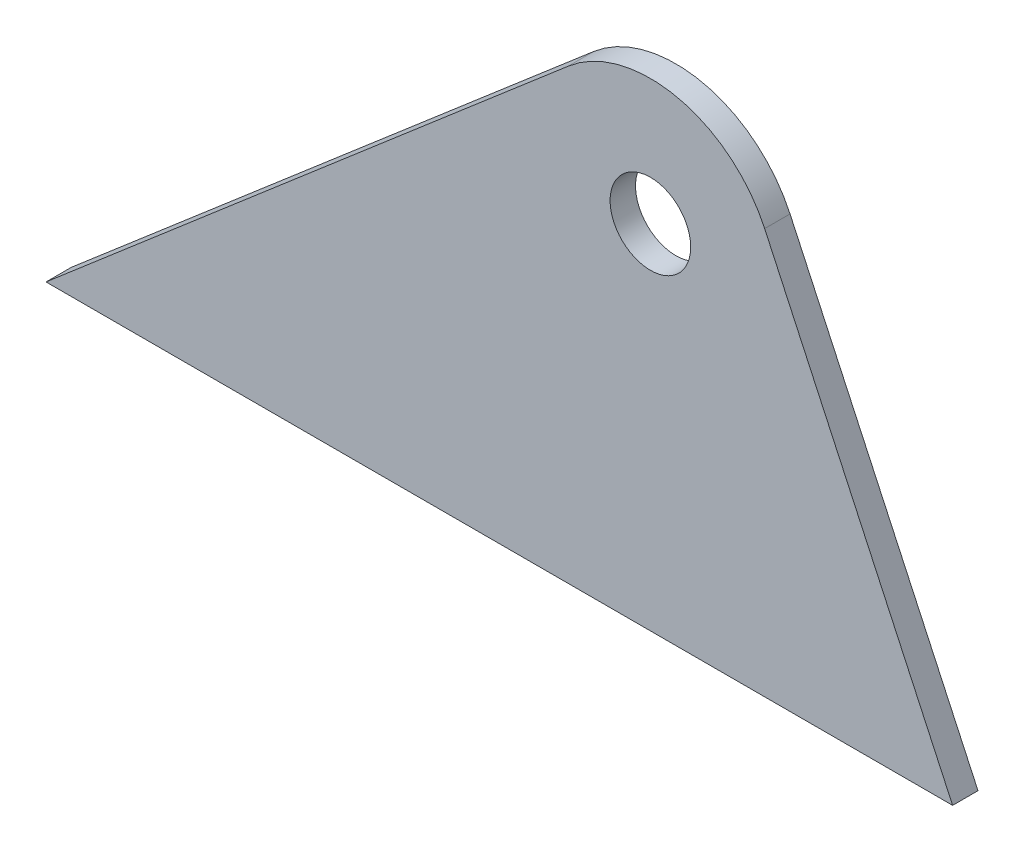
from build123d import *

# Parameters (mm, degrees)
SKETCH1_R      = 2.54
EXTRUDE1_DEPTH = 1.6002


with BuildPart() as part:
    # Sketch1 → Extrude1 (new body)
    with BuildSketch(Plane.XY):
        with BuildLine():
            Line((-5.167993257, 6.024595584), (-38.1, -22.225))
            Line((-38.1, -22.225), (19.05, -22.225))
            Line((19.05, -22.225), (7.201538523, 3.337925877))
            ThreePointArc((7.201538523, 3.337925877), (1.68474779, 7.756644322), (-5.167993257, 6.024595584))
        make_face()
        Circle(SKETCH1_R, mode=Mode.SUBTRACT)
    extrude(amount=EXTRUDE1_DEPTH)


solid = part.part
